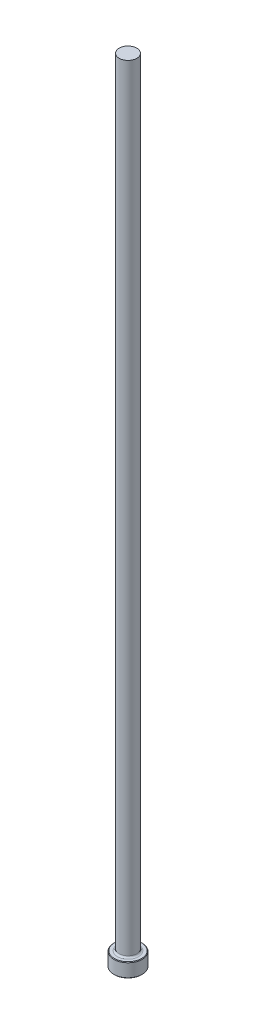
ISO-10303-21;
HEADER;
FILE_DESCRIPTION(('STEP AP214'),'2;1');
FILE_NAME('part.step','',(''),(''),'','','');
FILE_SCHEMA(('AUTOMOTIVE_DESIGN { 1 0 10303 214 1 1 1 1 }'));
ENDSEC;
DATA;
#1=APPLICATION_CONTEXT('core data for automotive mechanical design processes');
#2=APPLICATION_PROTOCOL_DEFINITION('international standard','automotive_design',2000,#1);
#3=PRODUCT_CONTEXT('',#1,'mechanical');
#4=PRODUCT('Part','Part','',(#3));
#5=PRODUCT_RELATED_PRODUCT_CATEGORY('part','',(#4));
#6=PRODUCT_DEFINITION_FORMATION('','',#4);
#7=PRODUCT_DEFINITION_CONTEXT('part definition',#1,'design');
#8=PRODUCT_DEFINITION('design','',#6,#7);
#9=PRODUCT_DEFINITION_SHAPE('','',#8);
#10=(LENGTH_UNIT() NAMED_UNIT(*) SI_UNIT(.MILLI.,.METRE.));
#11=(NAMED_UNIT(*) PLANE_ANGLE_UNIT() SI_UNIT($,.RADIAN.));
#12=(NAMED_UNIT(*) SI_UNIT($,.STERADIAN.) SOLID_ANGLE_UNIT());
#13=UNCERTAINTY_MEASURE_WITH_UNIT(LENGTH_MEASURE(1.E-05),#10,'distance_accuracy_value','');
#14=(GEOMETRIC_REPRESENTATION_CONTEXT(3) GLOBAL_UNCERTAINTY_ASSIGNED_CONTEXT((#13)) GLOBAL_UNIT_ASSIGNED_CONTEXT((#10,
#11,#12)) REPRESENTATION_CONTEXT('',''));
#15=CARTESIAN_POINT('',(0.,0.,0.));
#16=DIRECTION('',(0.,0.,1.));
#17=DIRECTION('',(1.,0.,0.));
#18=AXIS2_PLACEMENT_3D('',#15,#16,#17);
#19=CARTESIAN_POINT('',(0.,0.,0.));
#20=DIRECTION('',(0.,-1.,0.));
#21=DIRECTION('',(0.,0.,-1.));
#22=AXIS2_PLACEMENT_3D('',#19,#20,#21);
#23=PLANE('',#22);
#24=CARTESIAN_POINT('',(0.,0.,0.));
#25=DIRECTION('',(0.,-1.,0.));
#26=DIRECTION('',(0.,0.,-1.));
#27=AXIS2_PLACEMENT_3D('',#24,#25,#26);
#28=CIRCLE('',#27,6.09599999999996);
#29=CARTESIAN_POINT('',(0.,0.,-6.09599999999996));
#30=VERTEX_POINT('',#29);
#31=EDGE_CURVE('E46',#30,#30,#28,.T.);
#32=ORIENTED_EDGE('',*,*,#31,.T.);
#33=EDGE_LOOP('',(#32));
#34=FACE_BOUND('',#33,.T.);
#35=ADVANCED_FACE('F35',(#34),#23,.T.);
#36=CARTESIAN_POINT('',(0.,259.958771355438,0.));
#37=DIRECTION('',(0.,1.,0.));
#38=DIRECTION('',(0.,0.,1.));
#39=AXIS2_PLACEMENT_3D('',#36,#37,#38);
#40=CYLINDRICAL_SURFACE('',#39,6.34999999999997);
#41=CARTESIAN_POINT('',(0.,6.09600000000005,0.));
#42=DIRECTION('',(0.,1.,0.));
#43=DIRECTION('',(0.,0.,1.));
#44=AXIS2_PLACEMENT_3D('',#41,#42,#43);
#45=CIRCLE('',#44,6.34999999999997);
#46=CARTESIAN_POINT('',(0.,6.09600000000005,6.34999999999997));
#47=VERTEX_POINT('',#46);
#48=EDGE_CURVE('E50',#47,#47,#45,.F.);
#49=ORIENTED_EDGE('',*,*,#48,.T.);
#50=EDGE_LOOP('',(#49));
#51=FACE_BOUND('',#50,.T.);
#52=CARTESIAN_POINT('',(0.,0.254000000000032,0.));
#53=DIRECTION('',(0.,-1.,0.));
#54=DIRECTION('',(0.,0.,-1.));
#55=AXIS2_PLACEMENT_3D('',#52,#53,#54);
#56=CIRCLE('',#55,6.34999999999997);
#57=CARTESIAN_POINT('',(0.,0.254000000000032,-6.34999999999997));
#58=VERTEX_POINT('',#57);
#59=EDGE_CURVE('E55',#58,#58,#56,.F.);
#60=ORIENTED_EDGE('',*,*,#59,.T.);
#61=EDGE_LOOP('',(#60));
#62=FACE_BOUND('',#61,.T.);
#63=ADVANCED_FACE('F77',(#51,#62),#40,.T.);
#64=CARTESIAN_POINT('',(-6.34999999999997,6.35,0.));
#65=DIRECTION('',(0.,1.,0.));
#66=DIRECTION('',(0.,0.,1.));
#67=AXIS2_PLACEMENT_3D('',#64,#65,#66);
#68=PLANE('',#67);
#69=CARTESIAN_POINT('',(0.,6.35,0.));
#70=DIRECTION('',(0.,1.,0.));
#71=DIRECTION('',(0.,0.,1.));
#72=AXIS2_PLACEMENT_3D('',#69,#70,#71);
#73=CIRCLE('',#72,4.73074999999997);
#74=CARTESIAN_POINT('',(0.,6.35,4.73074999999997));
#75=VERTEX_POINT('',#74);
#76=EDGE_CURVE('E10',#75,#75,#73,.F.);
#77=ORIENTED_EDGE('',*,*,#76,.T.);
#78=EDGE_LOOP('',(#77));
#79=FACE_BOUND('',#78,.T.);
#80=CARTESIAN_POINT('',(0.,6.35,0.));
#81=DIRECTION('',(0.,1.,0.));
#82=DIRECTION('',(0.,0.,1.));
#83=AXIS2_PLACEMENT_3D('',#80,#81,#82);
#84=CIRCLE('',#83,6.09600000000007);
#85=CARTESIAN_POINT('',(0.,6.35,6.09600000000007));
#86=VERTEX_POINT('',#85);
#87=EDGE_CURVE('E58',#86,#86,#84,.T.);
#88=ORIENTED_EDGE('',*,*,#87,.T.);
#89=EDGE_LOOP('',(#88));
#90=FACE_BOUND('',#89,.T.);
#91=ADVANCED_FACE('F69',(#79,#90),#68,.T.);
#92=CARTESIAN_POINT('',(0.,259.958771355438,0.));
#93=DIRECTION('',(0.,1.,0.));
#94=DIRECTION('',(0.,0.,1.));
#95=AXIS2_PLACEMENT_3D('',#92,#93,#94);
#96=CYLINDRICAL_SURFACE('',#95,3.96874999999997);
#97=CARTESIAN_POINT('',(0.,7.11200000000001,0.));
#98=DIRECTION('',(0.,1.,0.));
#99=DIRECTION('',(0.,0.,1.));
#100=AXIS2_PLACEMENT_3D('',#97,#98,#99);
#101=CIRCLE('',#100,3.96874999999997);
#102=CARTESIAN_POINT('',(0.,7.11200000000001,3.96874999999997));
#103=VERTEX_POINT('',#102);
#104=EDGE_CURVE('E42',#103,#103,#101,.T.);
#105=ORIENTED_EDGE('',*,*,#104,.T.);
#106=EDGE_LOOP('',(#105));
#107=FACE_BOUND('',#106,.T.);
#108=CARTESIAN_POINT('',(0.,355.6,0.));
#109=DIRECTION('',(0.,1.,0.));
#110=DIRECTION('',(0.,0.,1.));
#111=AXIS2_PLACEMENT_3D('',#108,#109,#110);
#112=CIRCLE('',#111,3.96874999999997);
#113=CARTESIAN_POINT('',(0.,355.6,3.96874999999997));
#114=VERTEX_POINT('',#113);
#115=EDGE_CURVE('E61',#114,#114,#112,.T.);
#116=ORIENTED_EDGE('',*,*,#115,.F.);
#117=EDGE_LOOP('',(#116));
#118=FACE_BOUND('',#117,.T.);
#119=ADVANCED_FACE('F67',(#107,#118),#96,.T.);
#120=CARTESIAN_POINT('',(-3.96874999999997,355.6,0.));
#121=DIRECTION('',(0.,1.,0.));
#122=DIRECTION('',(0.,0.,1.));
#123=AXIS2_PLACEMENT_3D('',#120,#121,#122);
#124=PLANE('',#123);
#125=ORIENTED_EDGE('',*,*,#115,.T.);
#126=EDGE_LOOP('',(#125));
#127=FACE_BOUND('',#126,.T.);
#128=ADVANCED_FACE('F65',(#127),#124,.T.);
#129=CARTESIAN_POINT('',(0.,6.35000000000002,0.));
#130=DIRECTION('',(0.,-1.,0.));
#131=DIRECTION('',(0.,0.,-1.));
#132=AXIS2_PLACEMENT_3D('',#129,#130,#131);
#133=CONICAL_SURFACE('',#132,6.09600000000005,0.785398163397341);
#134=ORIENTED_EDGE('',*,*,#48,.F.);
#135=EDGE_LOOP('',(#134));
#136=FACE_BOUND('',#135,.T.);
#137=ORIENTED_EDGE('',*,*,#87,.F.);
#138=EDGE_LOOP('',(#137));
#139=FACE_BOUND('',#138,.T.);
#140=ADVANCED_FACE('F75',(#136,#139),#133,.T.);
#141=CARTESIAN_POINT('',(0.,0.254000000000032,0.));
#142=DIRECTION('',(0.,1.,0.));
#143=DIRECTION('',(0.,0.,1.));
#144=AXIS2_PLACEMENT_3D('',#141,#142,#143);
#145=CONICAL_SURFACE('',#144,6.34999999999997,0.785398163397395);
#146=ORIENTED_EDGE('',*,*,#31,.F.);
#147=EDGE_LOOP('',(#146));
#148=FACE_BOUND('',#147,.T.);
#149=ORIENTED_EDGE('',*,*,#59,.F.);
#150=EDGE_LOOP('',(#149));
#151=FACE_BOUND('',#150,.T.);
#152=ADVANCED_FACE('F89',(#148,#151),#145,.T.);
#153=CARTESIAN_POINT('',(0.,7.11200000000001,0.));
#154=DIRECTION('',(0.,1.,0.));
#155=DIRECTION('',(0.,0.,1.));
#156=AXIS2_PLACEMENT_3D('',#153,#154,#155);
#157=TOROIDAL_SURFACE('',#156,4.73074999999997,0.762);
#158=ORIENTED_EDGE('',*,*,#76,.F.);
#159=EDGE_LOOP('',(#158));
#160=FACE_BOUND('',#159,.T.);
#161=ORIENTED_EDGE('',*,*,#104,.F.);
#162=EDGE_LOOP('',(#161));
#163=FACE_BOUND('',#162,.T.);
#164=ADVANCED_FACE('F37',(#160,#163),#157,.F.);
#165=CLOSED_SHELL('',(#35,#63,#91,#119,#128,#140,#152,#164));
#166=MANIFOLD_SOLID_BREP('B2',#165);
#167=ADVANCED_BREP_SHAPE_REPRESENTATION('',(#18,#166),#14);
#168=SHAPE_DEFINITION_REPRESENTATION(#9,#167);
ENDSEC;
END-ISO-10303-21;
